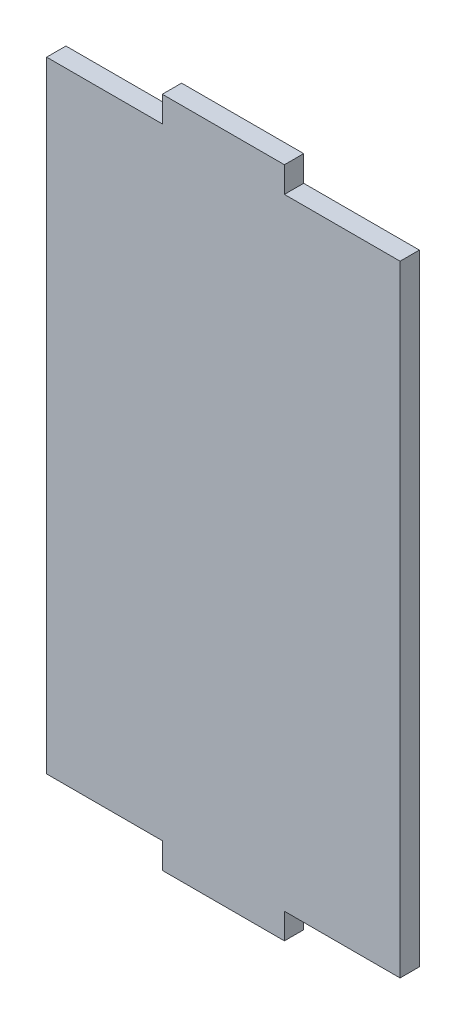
ISO-10303-21;
HEADER;
FILE_DESCRIPTION(('STEP AP214'),'2;1');
FILE_NAME('part.step','',(''),(''),'','','');
FILE_SCHEMA(('AUTOMOTIVE_DESIGN { 1 0 10303 214 1 1 1 1 }'));
ENDSEC;
DATA;
#1=APPLICATION_CONTEXT('core data for automotive mechanical design processes');
#2=APPLICATION_PROTOCOL_DEFINITION('international standard','automotive_design',2000,#1);
#3=PRODUCT_CONTEXT('',#1,'mechanical');
#4=PRODUCT('Part','Part','',(#3));
#5=PRODUCT_RELATED_PRODUCT_CATEGORY('part','',(#4));
#6=PRODUCT_DEFINITION_FORMATION('','',#4);
#7=PRODUCT_DEFINITION_CONTEXT('part definition',#1,'design');
#8=PRODUCT_DEFINITION('design','',#6,#7);
#9=PRODUCT_DEFINITION_SHAPE('','',#8);
#10=(LENGTH_UNIT() NAMED_UNIT(*) SI_UNIT(.MILLI.,.METRE.));
#11=(NAMED_UNIT(*) PLANE_ANGLE_UNIT() SI_UNIT($,.RADIAN.));
#12=(NAMED_UNIT(*) SI_UNIT($,.STERADIAN.) SOLID_ANGLE_UNIT());
#13=UNCERTAINTY_MEASURE_WITH_UNIT(LENGTH_MEASURE(1.E-05),#10,'distance_accuracy_value','');
#14=(GEOMETRIC_REPRESENTATION_CONTEXT(3) GLOBAL_UNCERTAINTY_ASSIGNED_CONTEXT((#13)) GLOBAL_UNIT_ASSIGNED_CONTEXT((#10,
#11,#12)) REPRESENTATION_CONTEXT('',''));
#15=CARTESIAN_POINT('',(0.,0.,0.));
#16=DIRECTION('',(0.,0.,1.));
#17=DIRECTION('',(1.,0.,0.));
#18=AXIS2_PLACEMENT_3D('',#15,#16,#17);
#19=CARTESIAN_POINT('',(0.,0.,0.28));
#20=DIRECTION('',(0.,0.,1.));
#21=DIRECTION('',(1.,0.,0.));
#22=AXIS2_PLACEMENT_3D('',#19,#20,#21);
#23=PLANE('',#22);
#24=DIRECTION('',(0.,1.,0.));
#25=VECTOR('',#24,1.);
#26=CARTESIAN_POINT('',(0.475,-2.615,0.28));
#27=LINE('',#26,#25);
#28=CARTESIAN_POINT('',(0.475,-2.415,0.28));
#29=VERTEX_POINT('',#28);
#30=CARTESIAN_POINT('',(0.475,-2.615,0.28));
#31=VERTEX_POINT('',#30);
#32=EDGE_CURVE('E130',#29,#31,#27,.F.);
#33=ORIENTED_EDGE('',*,*,#32,.F.);
#34=DIRECTION('',(1.,0.,0.));
#35=VECTOR('',#34,1.);
#36=CARTESIAN_POINT('',(-1.375,-2.415,0.28));
#37=LINE('',#36,#35);
#38=CARTESIAN_POINT('',(1.375,-2.415,0.28));
#39=VERTEX_POINT('',#38);
#40=EDGE_CURVE('E134',#39,#29,#37,.F.);
#41=ORIENTED_EDGE('',*,*,#40,.F.);
#42=DIRECTION('',(0.,1.,0.));
#43=VECTOR('',#42,1.);
#44=CARTESIAN_POINT('',(1.375,-2.415,0.28));
#45=LINE('',#44,#43);
#46=CARTESIAN_POINT('',(1.375,2.415,0.28));
#47=VERTEX_POINT('',#46);
#48=EDGE_CURVE('E138',#47,#39,#45,.F.);
#49=ORIENTED_EDGE('',*,*,#48,.F.);
#50=DIRECTION('',(1.,0.,0.));
#51=VECTOR('',#50,1.);
#52=CARTESIAN_POINT('',(1.375,2.415,0.28));
#53=LINE('',#52,#51);
#54=CARTESIAN_POINT('',(0.475,2.415,0.28));
#55=VERTEX_POINT('',#54);
#56=EDGE_CURVE('E142',#55,#47,#53,.T.);
#57=ORIENTED_EDGE('',*,*,#56,.F.);
#58=DIRECTION('',(0.,1.,0.));
#59=VECTOR('',#58,1.);
#60=CARTESIAN_POINT('',(0.475,2.415,0.28));
#61=LINE('',#60,#59);
#62=CARTESIAN_POINT('',(0.475,2.615,0.28));
#63=VERTEX_POINT('',#62);
#64=EDGE_CURVE('E146',#63,#55,#61,.F.);
#65=ORIENTED_EDGE('',*,*,#64,.F.);
#66=DIRECTION('',(1.,0.,0.));
#67=VECTOR('',#66,1.);
#68=CARTESIAN_POINT('',(0.475,2.615,0.28));
#69=LINE('',#68,#67);
#70=CARTESIAN_POINT('',(-0.475,2.615,0.28));
#71=VERTEX_POINT('',#70);
#72=EDGE_CURVE('E150',#71,#63,#69,.T.);
#73=ORIENTED_EDGE('',*,*,#72,.F.);
#74=DIRECTION('',(0.,1.,0.));
#75=VECTOR('',#74,1.);
#76=CARTESIAN_POINT('',(-0.475,2.615,0.28));
#77=LINE('',#76,#75);
#78=CARTESIAN_POINT('',(-0.475,2.415,0.28));
#79=VERTEX_POINT('',#78);
#80=EDGE_CURVE('E154',#79,#71,#77,.T.);
#81=ORIENTED_EDGE('',*,*,#80,.F.);
#82=DIRECTION('',(1.,0.,0.));
#83=VECTOR('',#82,1.);
#84=CARTESIAN_POINT('',(1.375,2.415,0.28));
#85=LINE('',#84,#83);
#86=CARTESIAN_POINT('',(-1.375,2.415,0.28));
#87=VERTEX_POINT('',#86);
#88=EDGE_CURVE('E158',#87,#79,#85,.T.);
#89=ORIENTED_EDGE('',*,*,#88,.F.);
#90=DIRECTION('',(0.,1.,0.));
#91=VECTOR('',#90,1.);
#92=CARTESIAN_POINT('',(-1.375,2.415,0.28));
#93=LINE('',#92,#91);
#94=CARTESIAN_POINT('',(-1.375,-2.415,0.28));
#95=VERTEX_POINT('',#94);
#96=EDGE_CURVE('E119',#95,#87,#93,.T.);
#97=ORIENTED_EDGE('',*,*,#96,.F.);
#98=DIRECTION('',(1.,0.,0.));
#99=VECTOR('',#98,1.);
#100=CARTESIAN_POINT('',(-1.375,-2.415,0.28));
#101=LINE('',#100,#99);
#102=CARTESIAN_POINT('',(-0.475,-2.415,0.28));
#103=VERTEX_POINT('',#102);
#104=EDGE_CURVE('E20',#103,#95,#101,.F.);
#105=ORIENTED_EDGE('',*,*,#104,.F.);
#106=DIRECTION('',(0.,1.,0.));
#107=VECTOR('',#106,1.);
#108=CARTESIAN_POINT('',(-0.475,-2.415,0.28));
#109=LINE('',#108,#107);
#110=CARTESIAN_POINT('',(-0.475,-2.615,0.28));
#111=VERTEX_POINT('',#110);
#112=EDGE_CURVE('E107',#111,#103,#109,.T.);
#113=ORIENTED_EDGE('',*,*,#112,.F.);
#114=DIRECTION('',(1.,0.,0.));
#115=VECTOR('',#114,1.);
#116=CARTESIAN_POINT('',(-0.475,-2.615,0.28));
#117=LINE('',#116,#115);
#118=EDGE_CURVE('E102',#31,#111,#117,.F.);
#119=ORIENTED_EDGE('',*,*,#118,.F.);
#120=EDGE_LOOP('',(#33,#41,#49,#57,#65,#73,#81,#89,#97,#105,#113,#119));
#121=FACE_BOUND('',#120,.T.);
#122=ADVANCED_FACE('F17',(#121),#23,.T.);
#123=CARTESIAN_POINT('',(-1.375,-2.415,0.13));
#124=DIRECTION('',(0.,-1.,0.));
#125=DIRECTION('',(0.,0.,-1.));
#126=AXIS2_PLACEMENT_3D('',#123,#124,#125);
#127=PLANE('',#126);
#128=DIRECTION('',(1.,0.,0.));
#129=VECTOR('',#128,1.);
#130=CARTESIAN_POINT('',(0.,-2.415,0.13));
#131=LINE('',#130,#129);
#132=CARTESIAN_POINT('',(-1.375,-2.415,0.13));
#133=VERTEX_POINT('',#132);
#134=CARTESIAN_POINT('',(-0.475,-2.415,0.13));
#135=VERTEX_POINT('',#134);
#136=EDGE_CURVE('E125',#133,#135,#131,.T.);
#137=ORIENTED_EDGE('',*,*,#136,.T.);
#138=DIRECTION('',(0.,0.,1.));
#139=VECTOR('',#138,1.);
#140=CARTESIAN_POINT('',(-0.475,-2.415,0.13));
#141=LINE('',#140,#139);
#142=EDGE_CURVE('E112',#103,#135,#141,.F.);
#143=ORIENTED_EDGE('',*,*,#142,.F.);
#144=ORIENTED_EDGE('',*,*,#104,.T.);
#145=DIRECTION('',(0.,0.,1.));
#146=VECTOR('',#145,1.);
#147=CARTESIAN_POINT('',(-1.375,-2.415,0.13));
#148=LINE('',#147,#146);
#149=EDGE_CURVE('E162',#133,#95,#148,.T.);
#150=ORIENTED_EDGE('',*,*,#149,.F.);
#151=EDGE_LOOP('',(#137,#143,#144,#150));
#152=FACE_BOUND('',#151,.T.);
#153=ADVANCED_FACE('F124',(#152),#127,.T.);
#154=CARTESIAN_POINT('',(-0.475,-2.415,0.13));
#155=DIRECTION('',(-1.,0.,0.));
#156=DIRECTION('',(0.,0.,1.));
#157=AXIS2_PLACEMENT_3D('',#154,#155,#156);
#158=PLANE('',#157);
#159=ORIENTED_EDGE('',*,*,#112,.T.);
#160=ORIENTED_EDGE('',*,*,#142,.T.);
#161=DIRECTION('',(0.,1.,0.));
#162=VECTOR('',#161,1.);
#163=CARTESIAN_POINT('',(-0.475,0.,0.13));
#164=LINE('',#163,#162);
#165=CARTESIAN_POINT('',(-0.475,-2.615,0.13));
#166=VERTEX_POINT('',#165);
#167=EDGE_CURVE('E167',#135,#166,#164,.F.);
#168=ORIENTED_EDGE('',*,*,#167,.T.);
#169=DIRECTION('',(0.,0.,-1.));
#170=VECTOR('',#169,1.);
#171=CARTESIAN_POINT('',(-0.475,-2.615,0.13));
#172=LINE('',#171,#170);
#173=EDGE_CURVE('E114',#111,#166,#172,.T.);
#174=ORIENTED_EDGE('',*,*,#173,.F.);
#175=EDGE_LOOP('',(#159,#160,#168,#174));
#176=FACE_BOUND('',#175,.T.);
#177=ADVANCED_FACE('F109',(#176),#158,.T.);
#178=CARTESIAN_POINT('',(-0.475,-2.615,0.13));
#179=DIRECTION('',(0.,-1.,0.));
#180=DIRECTION('',(0.,0.,-1.));
#181=AXIS2_PLACEMENT_3D('',#178,#179,#180);
#182=PLANE('',#181);
#183=ORIENTED_EDGE('',*,*,#173,.T.);
#184=DIRECTION('',(1.,0.,0.));
#185=VECTOR('',#184,1.);
#186=CARTESIAN_POINT('',(0.,-2.615,0.13));
#187=LINE('',#186,#185);
#188=CARTESIAN_POINT('',(0.475,-2.615,0.13));
#189=VERTEX_POINT('',#188);
#190=EDGE_CURVE('E169',#166,#189,#187,.T.);
#191=ORIENTED_EDGE('',*,*,#190,.T.);
#192=DIRECTION('',(0.,0.,-1.));
#193=VECTOR('',#192,1.);
#194=CARTESIAN_POINT('',(0.475,-2.615,0.13));
#195=LINE('',#194,#193);
#196=EDGE_CURVE('E132',#31,#189,#195,.T.);
#197=ORIENTED_EDGE('',*,*,#196,.F.);
#198=ORIENTED_EDGE('',*,*,#118,.T.);
#199=EDGE_LOOP('',(#183,#191,#197,#198));
#200=FACE_BOUND('',#199,.T.);
#201=ADVANCED_FACE('F234',(#200),#182,.T.);
#202=CARTESIAN_POINT('',(0.475,-2.615,0.13));
#203=DIRECTION('',(1.,0.,0.));
#204=DIRECTION('',(0.,0.,-1.));
#205=AXIS2_PLACEMENT_3D('',#202,#203,#204);
#206=PLANE('',#205);
#207=DIRECTION('',(0.,1.,0.));
#208=VECTOR('',#207,1.);
#209=CARTESIAN_POINT('',(0.475,0.,0.13));
#210=LINE('',#209,#208);
#211=CARTESIAN_POINT('',(0.475,-2.415,0.13));
#212=VERTEX_POINT('',#211);
#213=EDGE_CURVE('E172',#189,#212,#210,.T.);
#214=ORIENTED_EDGE('',*,*,#213,.T.);
#215=DIRECTION('',(0.,0.,-1.));
#216=VECTOR('',#215,1.);
#217=CARTESIAN_POINT('',(0.475,-2.415,0.13));
#218=LINE('',#217,#216);
#219=EDGE_CURVE('E136',#29,#212,#218,.T.);
#220=ORIENTED_EDGE('',*,*,#219,.F.);
#221=ORIENTED_EDGE('',*,*,#32,.T.);
#222=ORIENTED_EDGE('',*,*,#196,.T.);
#223=EDGE_LOOP('',(#214,#220,#221,#222));
#224=FACE_BOUND('',#223,.T.);
#225=ADVANCED_FACE('F233',(#224),#206,.T.);
#226=CARTESIAN_POINT('',(-1.375,-2.415,0.13));
#227=DIRECTION('',(0.,-1.,0.));
#228=DIRECTION('',(0.,0.,-1.));
#229=AXIS2_PLACEMENT_3D('',#226,#227,#228);
#230=PLANE('',#229);
#231=ORIENTED_EDGE('',*,*,#40,.T.);
#232=ORIENTED_EDGE('',*,*,#219,.T.);
#233=DIRECTION('',(1.,0.,0.));
#234=VECTOR('',#233,1.);
#235=CARTESIAN_POINT('',(0.,-2.415,0.13));
#236=LINE('',#235,#234);
#237=CARTESIAN_POINT('',(1.375,-2.415,0.13));
#238=VERTEX_POINT('',#237);
#239=EDGE_CURVE('E175',#212,#238,#236,.T.);
#240=ORIENTED_EDGE('',*,*,#239,.T.);
#241=DIRECTION('',(0.,0.,-1.));
#242=VECTOR('',#241,1.);
#243=CARTESIAN_POINT('',(1.375,-2.415,0.13));
#244=LINE('',#243,#242);
#245=EDGE_CURVE('E140',#39,#238,#244,.T.);
#246=ORIENTED_EDGE('',*,*,#245,.F.);
#247=EDGE_LOOP('',(#231,#232,#240,#246));
#248=FACE_BOUND('',#247,.T.);
#249=ADVANCED_FACE('F228',(#248),#230,.T.);
#250=CARTESIAN_POINT('',(1.375,-2.415,0.13));
#251=DIRECTION('',(1.,0.,0.));
#252=DIRECTION('',(0.,0.,-1.));
#253=AXIS2_PLACEMENT_3D('',#250,#251,#252);
#254=PLANE('',#253);
#255=ORIENTED_EDGE('',*,*,#245,.T.);
#256=DIRECTION('',(0.,1.,0.));
#257=VECTOR('',#256,1.);
#258=CARTESIAN_POINT('',(1.375,0.,0.13));
#259=LINE('',#258,#257);
#260=CARTESIAN_POINT('',(1.375,2.415,0.13));
#261=VERTEX_POINT('',#260);
#262=EDGE_CURVE('E178',#238,#261,#259,.T.);
#263=ORIENTED_EDGE('',*,*,#262,.T.);
#264=DIRECTION('',(0.,0.,1.));
#265=VECTOR('',#264,1.);
#266=CARTESIAN_POINT('',(1.375,2.415,0.13));
#267=LINE('',#266,#265);
#268=EDGE_CURVE('E144',#47,#261,#267,.F.);
#269=ORIENTED_EDGE('',*,*,#268,.F.);
#270=ORIENTED_EDGE('',*,*,#48,.T.);
#271=EDGE_LOOP('',(#255,#263,#269,#270));
#272=FACE_BOUND('',#271,.T.);
#273=ADVANCED_FACE('F224',(#272),#254,.T.);
#274=CARTESIAN_POINT('',(1.375,2.415,0.13));
#275=DIRECTION('',(0.,1.,0.));
#276=DIRECTION('',(0.,0.,1.));
#277=AXIS2_PLACEMENT_3D('',#274,#275,#276);
#278=PLANE('',#277);
#279=DIRECTION('',(1.,0.,0.));
#280=VECTOR('',#279,1.);
#281=CARTESIAN_POINT('',(0.,2.415,0.13));
#282=LINE('',#281,#280);
#283=CARTESIAN_POINT('',(0.475,2.415,0.13));
#284=VERTEX_POINT('',#283);
#285=EDGE_CURVE('E181',#261,#284,#282,.F.);
#286=ORIENTED_EDGE('',*,*,#285,.T.);
#287=DIRECTION('',(0.,0.,-1.));
#288=VECTOR('',#287,1.);
#289=CARTESIAN_POINT('',(0.475,2.415,0.13));
#290=LINE('',#289,#288);
#291=EDGE_CURVE('E148',#55,#284,#290,.T.);
#292=ORIENTED_EDGE('',*,*,#291,.F.);
#293=ORIENTED_EDGE('',*,*,#56,.T.);
#294=ORIENTED_EDGE('',*,*,#268,.T.);
#295=EDGE_LOOP('',(#286,#292,#293,#294));
#296=FACE_BOUND('',#295,.T.);
#297=ADVANCED_FACE('F218',(#296),#278,.T.);
#298=CARTESIAN_POINT('',(0.475,2.415,0.13));
#299=DIRECTION('',(1.,0.,0.));
#300=DIRECTION('',(0.,0.,-1.));
#301=AXIS2_PLACEMENT_3D('',#298,#299,#300);
#302=PLANE('',#301);
#303=ORIENTED_EDGE('',*,*,#64,.T.);
#304=ORIENTED_EDGE('',*,*,#291,.T.);
#305=DIRECTION('',(0.,1.,0.));
#306=VECTOR('',#305,1.);
#307=CARTESIAN_POINT('',(0.475,0.,0.13));
#308=LINE('',#307,#306);
#309=CARTESIAN_POINT('',(0.475,2.615,0.13));
#310=VERTEX_POINT('',#309);
#311=EDGE_CURVE('E184',#284,#310,#308,.T.);
#312=ORIENTED_EDGE('',*,*,#311,.T.);
#313=DIRECTION('',(0.,0.,1.));
#314=VECTOR('',#313,1.);
#315=CARTESIAN_POINT('',(0.475,2.615,0.13));
#316=LINE('',#315,#314);
#317=EDGE_CURVE('E152',#63,#310,#316,.F.);
#318=ORIENTED_EDGE('',*,*,#317,.F.);
#319=EDGE_LOOP('',(#303,#304,#312,#318));
#320=FACE_BOUND('',#319,.T.);
#321=ADVANCED_FACE('F214',(#320),#302,.T.);
#322=CARTESIAN_POINT('',(0.475,2.615,0.13));
#323=DIRECTION('',(0.,1.,0.));
#324=DIRECTION('',(0.,0.,1.));
#325=AXIS2_PLACEMENT_3D('',#322,#323,#324);
#326=PLANE('',#325);
#327=ORIENTED_EDGE('',*,*,#317,.T.);
#328=DIRECTION('',(1.,0.,0.));
#329=VECTOR('',#328,1.);
#330=CARTESIAN_POINT('',(0.,2.615,0.13));
#331=LINE('',#330,#329);
#332=CARTESIAN_POINT('',(-0.475,2.615,0.13));
#333=VERTEX_POINT('',#332);
#334=EDGE_CURVE('E187',#310,#333,#331,.F.);
#335=ORIENTED_EDGE('',*,*,#334,.T.);
#336=DIRECTION('',(0.,0.,1.));
#337=VECTOR('',#336,1.);
#338=CARTESIAN_POINT('',(-0.475,2.615,0.13));
#339=LINE('',#338,#337);
#340=EDGE_CURVE('E156',#71,#333,#339,.F.);
#341=ORIENTED_EDGE('',*,*,#340,.F.);
#342=ORIENTED_EDGE('',*,*,#72,.T.);
#343=EDGE_LOOP('',(#327,#335,#341,#342));
#344=FACE_BOUND('',#343,.T.);
#345=ADVANCED_FACE('F208',(#344),#326,.T.);
#346=CARTESIAN_POINT('',(-0.475,2.615,0.13));
#347=DIRECTION('',(-1.,0.,0.));
#348=DIRECTION('',(0.,0.,1.));
#349=AXIS2_PLACEMENT_3D('',#346,#347,#348);
#350=PLANE('',#349);
#351=DIRECTION('',(0.,1.,0.));
#352=VECTOR('',#351,1.);
#353=CARTESIAN_POINT('',(-0.475,0.,0.13));
#354=LINE('',#353,#352);
#355=CARTESIAN_POINT('',(-0.475,2.415,0.13));
#356=VERTEX_POINT('',#355);
#357=EDGE_CURVE('E190',#333,#356,#354,.F.);
#358=ORIENTED_EDGE('',*,*,#357,.T.);
#359=DIRECTION('',(0.,0.,1.));
#360=VECTOR('',#359,1.);
#361=CARTESIAN_POINT('',(-0.475,2.415,0.13));
#362=LINE('',#361,#360);
#363=EDGE_CURVE('E160',#79,#356,#362,.F.);
#364=ORIENTED_EDGE('',*,*,#363,.F.);
#365=ORIENTED_EDGE('',*,*,#80,.T.);
#366=ORIENTED_EDGE('',*,*,#340,.T.);
#367=EDGE_LOOP('',(#358,#364,#365,#366));
#368=FACE_BOUND('',#367,.T.);
#369=ADVANCED_FACE('F203',(#368),#350,.T.);
#370=CARTESIAN_POINT('',(1.375,2.415,0.13));
#371=DIRECTION('',(0.,1.,0.));
#372=DIRECTION('',(0.,0.,1.));
#373=AXIS2_PLACEMENT_3D('',#370,#371,#372);
#374=PLANE('',#373);
#375=ORIENTED_EDGE('',*,*,#88,.T.);
#376=ORIENTED_EDGE('',*,*,#363,.T.);
#377=DIRECTION('',(1.,0.,0.));
#378=VECTOR('',#377,1.);
#379=CARTESIAN_POINT('',(0.,2.415,0.13));
#380=LINE('',#379,#378);
#381=CARTESIAN_POINT('',(-1.375,2.415,0.13));
#382=VERTEX_POINT('',#381);
#383=EDGE_CURVE('E26',#356,#382,#380,.F.);
#384=ORIENTED_EDGE('',*,*,#383,.T.);
#385=DIRECTION('',(0.,0.,1.));
#386=VECTOR('',#385,1.);
#387=CARTESIAN_POINT('',(-1.375,2.415,0.13));
#388=LINE('',#387,#386);
#389=EDGE_CURVE('E34',#87,#382,#388,.F.);
#390=ORIENTED_EDGE('',*,*,#389,.F.);
#391=EDGE_LOOP('',(#375,#376,#384,#390));
#392=FACE_BOUND('',#391,.T.);
#393=ADVANCED_FACE('F196',(#392),#374,.T.);
#394=CARTESIAN_POINT('',(-1.375,2.415,0.13));
#395=DIRECTION('',(-1.,0.,0.));
#396=DIRECTION('',(0.,0.,1.));
#397=AXIS2_PLACEMENT_3D('',#394,#395,#396);
#398=PLANE('',#397);
#399=ORIENTED_EDGE('',*,*,#389,.T.);
#400=DIRECTION('',(0.,1.,0.));
#401=VECTOR('',#400,1.);
#402=CARTESIAN_POINT('',(-1.375,0.,0.13));
#403=LINE('',#402,#401);
#404=EDGE_CURVE('E11',#382,#133,#403,.F.);
#405=ORIENTED_EDGE('',*,*,#404,.T.);
#406=ORIENTED_EDGE('',*,*,#149,.T.);
#407=ORIENTED_EDGE('',*,*,#96,.T.);
#408=EDGE_LOOP('',(#399,#405,#406,#407));
#409=FACE_BOUND('',#408,.T.);
#410=ADVANCED_FACE('F235',(#409),#398,.T.);
#411=CARTESIAN_POINT('',(0.,0.,0.13));
#412=DIRECTION('',(0.,0.,1.));
#413=DIRECTION('',(1.,0.,0.));
#414=AXIS2_PLACEMENT_3D('',#411,#412,#413);
#415=PLANE('',#414);
#416=ORIENTED_EDGE('',*,*,#383,.F.);
#417=ORIENTED_EDGE('',*,*,#357,.F.);
#418=ORIENTED_EDGE('',*,*,#334,.F.);
#419=ORIENTED_EDGE('',*,*,#311,.F.);
#420=ORIENTED_EDGE('',*,*,#285,.F.);
#421=ORIENTED_EDGE('',*,*,#262,.F.);
#422=ORIENTED_EDGE('',*,*,#239,.F.);
#423=ORIENTED_EDGE('',*,*,#213,.F.);
#424=ORIENTED_EDGE('',*,*,#190,.F.);
#425=ORIENTED_EDGE('',*,*,#167,.F.);
#426=ORIENTED_EDGE('',*,*,#136,.F.);
#427=ORIENTED_EDGE('',*,*,#404,.F.);
#428=EDGE_LOOP('',(#416,#417,#418,#419,#420,#421,#422,#423,#424,#425,#426,#427));
#429=FACE_BOUND('',#428,.T.);
#430=ADVANCED_FACE('F200',(#429),#415,.F.);
#431=CLOSED_SHELL('',(#122,#153,#177,#201,#225,#249,#273,#297,#321,#345,#369,#393,#410,#430));
#432=MANIFOLD_SOLID_BREP('B1',#431);
#433=ADVANCED_BREP_SHAPE_REPRESENTATION('',(#18,#432),#14);
#434=SHAPE_DEFINITION_REPRESENTATION(#9,#433);
ENDSEC;
END-ISO-10303-21;
